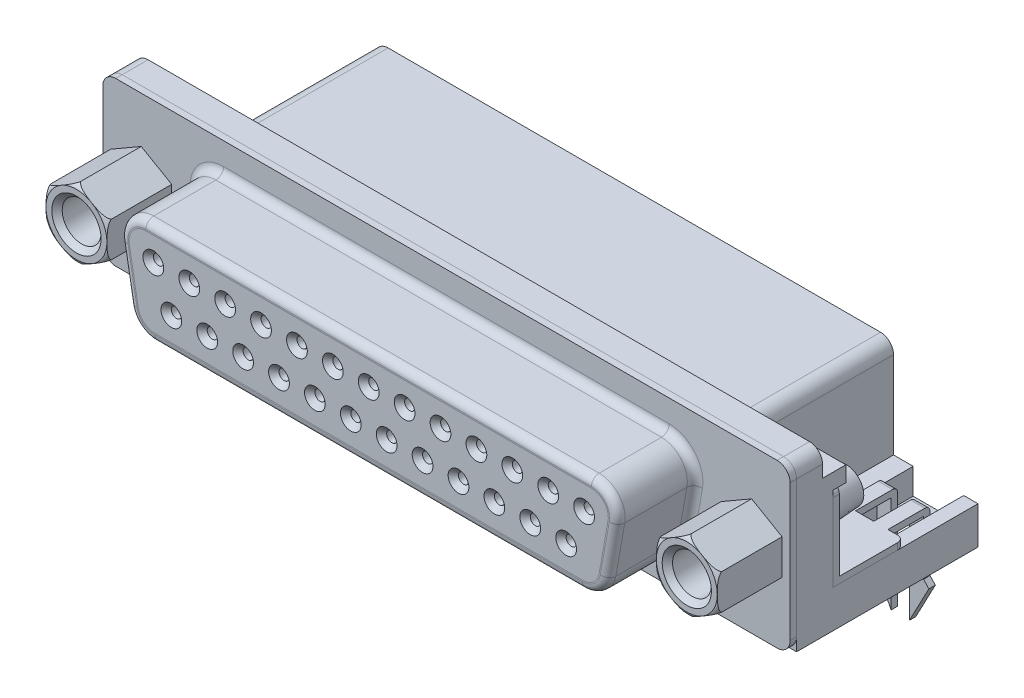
from build123d import *

# Parameters (mm, degrees)
EXTRUIR1_DEPTH         = 0.5
EXTRUIR2_DEPTH         = 6
CORTAR_EXTRUIR1_DEPTH  = 6
REDONDEO1_R            = 0.6
CROQUIS5_R             = 0.4
EXTRUIR3_DEPTH         = 6
CHAFL_N1_SIZE          = 0.4
CROQUIS6_R             = 1.6
CORTAR_EXTRUIR2_DEPTH  = 6
EXTRUIR4_DEPTH         = 5
CROQUIS9_R             = 1.5
CORTAR_EXTRUIR3_DEPTH  = 4
CHAFL_N2_SIZE          = 0.4
EXTRUIR5_DEPTH         = 14
CORTAR_EXTRUIR4_DEPTH  = 12
REDONDEO2_R            = 1
EXTRUIR6_DEPTH         = 53.04
CROQUIS13_W            = 3.9
CROQUIS13_H            = 13.996987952
CORTAR_EXTRUIR5_DEPTH  = 2
CROQUIS14_W            = 39.5
CROQUIS14_H            = 13.668273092
CORTAR_EXTRUIR6_DEPTH  = 0.6
EXTRUIR7_DEPTH         = 4.4
EXTRUIR7_DEPTH_BACK    = 2
CROQUIS15_W            = 0.7
CROQUIS15_H            = 0.7
EXTRUIR7_2_DEPTH       = 4.4
EXTRUIR7_2_DEPTH_BACK  = 2
EXTRUIR7_3_DEPTH       = 4.4
EXTRUIR7_3_DEPTH_BACK  = 2
EXTRUIR7_4_DEPTH       = 4.4
EXTRUIR7_4_DEPTH_BACK  = 2
EXTRUIR7_5_DEPTH       = 4.4
EXTRUIR7_5_DEPTH_BACK  = 2
EXTRUIR7_6_DEPTH       = 4.4
EXTRUIR7_6_DEPTH_BACK  = 2
EXTRUIR7_7_DEPTH       = 4.4
EXTRUIR7_7_DEPTH_BACK  = 2
EXTRUIR7_8_DEPTH       = 4.4
EXTRUIR7_8_DEPTH_BACK  = 2
EXTRUIR7_9_DEPTH       = 4.4
EXTRUIR7_9_DEPTH_BACK  = 2
EXTRUIR7_10_DEPTH      = 4.4
EXTRUIR7_10_DEPTH_BACK = 2
EXTRUIR7_11_DEPTH      = 4.4
EXTRUIR7_11_DEPTH_BACK = 2
EXTRUIR7_12_DEPTH      = 4.4
EXTRUIR7_12_DEPTH_BACK = 2
EXTRUIR7_13_DEPTH      = 4.4
EXTRUIR7_13_DEPTH_BACK = 2
EXTRUIR7_14_DEPTH      = 4.4
EXTRUIR7_14_DEPTH_BACK = 2
EXTRUIR7_15_DEPTH      = 4.4
EXTRUIR7_15_DEPTH_BACK = 2
EXTRUIR7_16_DEPTH      = 4.4
EXTRUIR7_16_DEPTH_BACK = 2
EXTRUIR7_17_DEPTH      = 4.4
EXTRUIR7_17_DEPTH_BACK = 2
EXTRUIR7_18_DEPTH      = 4.4
EXTRUIR7_18_DEPTH_BACK = 2
EXTRUIR7_19_DEPTH      = 4.4
EXTRUIR7_19_DEPTH_BACK = 2
EXTRUIR7_20_DEPTH      = 4.4
EXTRUIR7_20_DEPTH_BACK = 2
EXTRUIR7_21_DEPTH      = 4.4
EXTRUIR7_21_DEPTH_BACK = 2
EXTRUIR7_22_DEPTH      = 4.4
EXTRUIR7_22_DEPTH_BACK = 2
EXTRUIR7_23_DEPTH      = 4.4
EXTRUIR7_23_DEPTH_BACK = 2
EXTRUIR7_24_DEPTH      = 4.4
EXTRUIR7_24_DEPTH_BACK = 2
EXTRUIR7_25_DEPTH      = 4.4
EXTRUIR7_25_DEPTH_BACK = 2
CROQUIS16_W            = 0.7
CROQUIS16_H            = 4.035508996
CROQUIS16_H_2          = 6.875508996
CORTAR_EXTRUIR7_DEPTH  = 2
CORTAR_EXTRUIR9_DEPTH  = 4
EXTRUIR8_DEPTH         = 0.5
CROQUIS19_W            = 1.1
CROQUIS19_H            = 3.25
EXTRUIR9_DEPTH         = 0.5
REDONDEO3_R            = 0.4
EXTRUIR10_DEPTH        = 0.5
EXTRUIR10_2_DEPTH      = 0.5
REDONDEO4_R            = 0.4
CROQUIS21_R            = 1.6
EXTRUIR11_DEPTH        = 3.5
EXTRUIR11_TAPER        = 4
CROQUIS22_W            = 37
CROQUIS22_H            = 6
CROQUIS22_W_2          = 36.8
CROQUIS22_H_2          = 5.8
CORTAR_EXTRUIR10_DEPTH = 6.5


with BuildPart() as part:
    # Croquis1 → Extruir1 (new body)
    with BuildSketch(Plane.XY):
        with BuildLine():
            Line((-25.52, 6.275), (25.52, 6.275))
            ThreePointArc((25.52, 6.275), (26.227106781, 5.982106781), (26.52, 5.275))
            Line((26.52, 5.275), (26.52, -5.275))
            ThreePointArc((26.52, -5.275), (26.227106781, -5.982106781), (25.52, -6.275))
            Line((25.52, -6.275), (-25.52, -6.275))
            ThreePointArc((-25.52, -6.275), (-26.227106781, -5.982106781), (-26.52, -5.275))
            Line((-26.52, -5.275), (-26.52, 5.275))
            ThreePointArc((-26.52, 5.275), (-26.227106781, 5.982106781), (-25.52, 6.275))
        make_face()
    extrude(amount=EXTRUIR1_DEPTH)

    # Croquis2 → Extruir2 (add)
    with BuildSketch(Plane.XY.offset(0.5)):
        with BuildLine():
            Line((19.159615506, 1.602703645), (18.471940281, -2.297296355))
            ThreePointArc((18.471940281, -2.297296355), (17.787899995, -3.482088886), (16.502324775, -3.95))
            Line((16.502324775, -3.95), (-16.502324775, -3.95))
            ThreePointArc((-16.502324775, -3.95), (-17.787899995, -3.482088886), (-18.471940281, -2.297296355))
            Line((-18.471940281, -2.297296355), (-19.159615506, 1.602703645))
            ThreePointArc((-19.159615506, 1.602703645), (-18.722088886, 3.235575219), (-17.19, 3.95))
            Line((-17.19, 3.95), (17.19, 3.95))
            ThreePointArc((17.19, 3.95), (18.722088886, 3.235575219), (19.159615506, 1.602703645))
        make_face()
    extrude(amount=EXTRUIR2_DEPTH)

    # Croquis3 → Cortar-Extruir1 (cut)
    with BuildSketch(Plane.XY.offset(6.5)):
        with BuildLine():
            Line((17.19, 3.25), (-17.19, 3.25))
            ThreePointArc((-17.19, 3.25), (-18.185857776, 2.785623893), (-18.470250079, 1.724257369))
            Line((-18.470250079, 1.724257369), (-17.782574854, -2.175742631))
            ThreePointArc((-17.782574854, -2.175742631), (-17.337948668, -2.945857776), (-16.502324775, -3.25))
            Line((-16.502324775, -3.25), (16.502324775, -3.25))
            ThreePointArc((16.502324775, -3.25), (17.337948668, -2.945857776), (17.782574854, -2.175742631))
            Line((17.782574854, -2.175742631), (18.470250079, 1.724257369))
            ThreePointArc((18.470250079, 1.724257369), (18.185857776, 2.785623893), (17.19, 3.25))
        make_face()
    extrude(amount=-CORTAR_EXTRUIR1_DEPTH, mode=Mode.SUBTRACT)

    # Redondeo1
    redondeo1_edges = [part.edges().sort_by_distance(p)[0] for p in [
        (17.787899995, -3.482088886, 0.5),
        (18.815777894, -0.347296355, 0.5),
        (18.722088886, 3.235575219, 0.5),
        (0, 3.95, 0.5),
        (-18.722088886, 3.235575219, 0.5),
        (-18.815777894, -0.347296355, 0.5),
        (-17.787899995, -3.482088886, 0.5),
        (0, -3.95, 0.5),
        (17.787899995, -3.482088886, 6.5),
        (18.815777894, -0.347296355, 6.5),
        (18.722088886, 3.235575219, 6.5),
        (0, 3.95, 6.5),
        (-18.722088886, 3.235575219, 6.5),
        (-18.815777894, -0.347296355, 6.5),
        (-17.787899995, -3.482088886, 6.5),
        (0, -3.95, 6.5),
    ]]
    fillet(redondeo1_edges, radius=REDONDEO1_R)

    # Croquis6 → Cortar-Extruir2 (cut)
    with BuildSketch(Plane.XY.offset(0.5)):
        with Locations((23.55, 0)):
            Circle(CROQUIS6_R)
        with Locations((-23.55, 0)):
            Circle(CROQUIS6_R)
    extrude(amount=-CORTAR_EXTRUIR2_DEPTH, mode=Mode.SUBTRACT)


with BuildPart() as body_2:
    # Croquis5 → Extruir3 (new body)
    with BuildSketch(Plane.XY.offset(0.5)):
        with BuildLine():
            Line((17.19, 3.25), (-17.19, 3.25))
            ThreePointArc((-17.19, 3.25), (-18.185857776, 2.785623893), (-18.470250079, 1.724257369))
            Line((-18.470250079, 1.724257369), (-17.782574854, -2.175742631))
            ThreePointArc((-17.782574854, -2.175742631), (-17.337948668, -2.945857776), (-16.502324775, -3.25))
            Line((-16.502324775, -3.25), (16.502324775, -3.25))
            ThreePointArc((16.502324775, -3.25), (17.337948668, -2.945857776), (17.782574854, -2.175742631))
            Line((17.782574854, -2.175742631), (18.470250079, 1.724257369))
            ThreePointArc((18.470250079, 1.724257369), (18.185857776, 2.785623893), (17.19, 3.25))
        make_face()
        with Locations((16.625, 1.42)):
            Circle(CROQUIS5_R, mode=Mode.SUBTRACT)
        with Locations((13.855, 1.42)):
            Circle(CROQUIS5_R, mode=Mode.SUBTRACT)
        with Locations((11.085, 1.42)):
            Circle(CROQUIS5_R, mode=Mode.SUBTRACT)
        with Locations((8.315, 1.42)):
            Circle(CROQUIS5_R, mode=Mode.SUBTRACT)
        with Locations((5.545, 1.42)):
            Circle(CROQUIS5_R, mode=Mode.SUBTRACT)
        with Locations((2.775, 1.42)):
            Circle(CROQUIS5_R, mode=Mode.SUBTRACT)
        with Locations((0.005, 1.42)):
            Circle(CROQUIS5_R, mode=Mode.SUBTRACT)
        with Locations((-2.765, 1.42)):
            Circle(CROQUIS5_R, mode=Mode.SUBTRACT)
        with Locations((-5.535, 1.42)):
            Circle(CROQUIS5_R, mode=Mode.SUBTRACT)
        with Locations((-8.305, 1.42)):
            Circle(CROQUIS5_R, mode=Mode.SUBTRACT)
        with Locations((-11.075, 1.42)):
            Circle(CROQUIS5_R, mode=Mode.SUBTRACT)
        with Locations((-13.845, 1.42)):
            Circle(CROQUIS5_R, mode=Mode.SUBTRACT)
        with Locations((-16.615, 1.42)):
            Circle(CROQUIS5_R, mode=Mode.SUBTRACT)
        with Locations((15.24, -1.42)):
            Circle(CROQUIS5_R, mode=Mode.SUBTRACT)
        with Locations((12.47, -1.42)):
            Circle(CROQUIS5_R, mode=Mode.SUBTRACT)
        with Locations((9.7, -1.42)):
            Circle(CROQUIS5_R, mode=Mode.SUBTRACT)
        with Locations((6.93, -1.42)):
            Circle(CROQUIS5_R, mode=Mode.SUBTRACT)
        with Locations((4.16, -1.42)):
            Circle(CROQUIS5_R, mode=Mode.SUBTRACT)
        with Locations((1.39, -1.42)):
            Circle(CROQUIS5_R, mode=Mode.SUBTRACT)
        with Locations((-1.38, -1.42)):
            Circle(CROQUIS5_R, mode=Mode.SUBTRACT)
        with Locations((-4.15, -1.42)):
            Circle(CROQUIS5_R, mode=Mode.SUBTRACT)
        with Locations((-6.92, -1.42)):
            Circle(CROQUIS5_R, mode=Mode.SUBTRACT)
        with Locations((-9.69, -1.42)):
            Circle(CROQUIS5_R, mode=Mode.SUBTRACT)
        with Locations((-12.46, -1.42)):
            Circle(CROQUIS5_R, mode=Mode.SUBTRACT)
        with Locations((-15.23, -1.42)):
            Circle(CROQUIS5_R, mode=Mode.SUBTRACT)
    extrude(amount=EXTRUIR3_DEPTH)

    # Chafl_n1
    chafl_n1_edges = [body_2.edges().sort_by_distance(p)[0] for p in [
        (-7.32, -1.42, 6.5),
        (-10.09, -1.42, 6.5),
        (-12.86, -1.42, 6.5),
        (-15.63, -1.42, 6.5),
        (16.225, 1.42, 6.5),
        (13.455, 1.42, 6.5),
        (10.685, 1.42, 6.5),
        (7.915, 1.42, 6.5),
        (5.145, 1.42, 6.5),
        (2.375, 1.42, 6.5),
        (-0.395, 1.42, 6.5),
        (-3.165, 1.42, 6.5),
        (-5.935, 1.42, 6.5),
        (-8.705, 1.42, 6.5),
        (-11.475, 1.42, 6.5),
        (-14.245, 1.42, 6.5),
        (-17.015, 1.42, 6.5),
        (14.84, -1.42, 6.5),
        (12.07, -1.42, 6.5),
        (9.3, -1.42, 6.5),
        (6.53, -1.42, 6.5),
        (3.76, -1.42, 6.5),
        (0.99, -1.42, 6.5),
        (-1.78, -1.42, 6.5),
        (-4.55, -1.42, 6.5),
    ]]
    chamfer(chafl_n1_edges, length=CHAFL_N1_SIZE)


with BuildPart() as body_3:
    # Croquis7 → Extruir4 (new body)
    with BuildSketch(Plane.XY.offset(0.5)):
        Polygon((23.55, 2.713546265), (21.2, 1.356773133), (21.2, -1.356773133), (23.55, -2.713546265), (25.9, -1.356773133), (25.9, 1.356773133), align=None)
    extrude(amount=EXTRUIR4_DEPTH)

    # Croquis8 → Cortar-Revoluci_n1 (revolve, cut)
    with BuildSketch(Plane(origin=(23.55, 0, 0), x_dir=(0, 0, -1), z_dir=(1, 0, 0))):
        with BuildLine():
            Line((-5.162976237, 2.713546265), (-5.162976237, 5.085332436))
            Line((-5.162976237, 5.085332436), (-6.486384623, 5.085332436))
            Line((-6.486384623, 5.085332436), (-6.187801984, 2.35))
            Line((-6.187801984, 2.35), (-5.5, 2.35))
            ThreePointArc((-5.5, 2.35), (-5.375308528, 2.572396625), (-5.162976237, 2.713546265))
        make_face()
    revolve(axis=Axis((23.55, 0, 0), (0, 0, -1)), mode=Mode.SUBTRACT)

    # Croquis9 → Cortar-Extruir3 (cut)
    with BuildSketch(Plane.XY.offset(5.5)):
        with Locations((23.55, 0)):
            Circle(CROQUIS9_R)
    extrude(amount=-CORTAR_EXTRUIR3_DEPTH, mode=Mode.SUBTRACT)

    # Chafl_n2
    chafl_n2_edges = [body_3.edges().sort_by_distance(p)[0] for p in [
        (22.05, 0, 5.5),
    ]]
    chamfer(chafl_n2_edges, length=CHAFL_N2_SIZE)


with BuildPart() as body_4:
    # Simetr_a1: mirrored copy
    add(body_3.part.mirror(Plane(origin=(0, 0, 0), x_dir=(0, 0, 1), z_dir=(1, 0, 0))))


with BuildPart() as body_5:
    # Croquis10 → Extruir5 (new body)
    with BuildSketch(Plane(origin=(0, 0, 0), x_dir=(-1, 0, 0), z_dir=(0, 0, -1))):
        with BuildLine():
            Line((-25.52, 6.275), (25.52, 6.275))
            ThreePointArc((25.52, 6.275), (26.227106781, 5.982106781), (26.52, 5.275))
            Line((26.52, 5.275), (26.52, -6.275))
            Line((26.52, -6.275), (-26.52, -6.275))
            Line((-26.52, -6.275), (-26.52, 5.275))
            ThreePointArc((-26.52, 5.275), (-26.227106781, 5.982106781), (-25.52, 6.275))
        make_face()
    extrude(amount=EXTRUIR5_DEPTH)

    # Croquis11 → Cortar-Extruir4 (cut)
    with BuildSketch(Plane(origin=(0, 0, -14), x_dir=(-1, 0, 0), z_dir=(0, 0, -1))):
        Polygon((30.029317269, -3.375), (20, -3.375), (20, 4.325), (-20, 4.325), (-20, -3.375), (-30.65060241, -3.375), (-30.65060241, 10.825803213), (30.029317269, 10.825803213), align=None)
    extrude(amount=-CORTAR_EXTRUIR4_DEPTH, mode=Mode.SUBTRACT)

    # Redondeo2
    redondeo2_edges = [body_5.edges().sort_by_distance(p)[0] for p in [
        (-20, 4.325, -8),
        (20, 4.325, -8),
    ]]
    fillet(redondeo2_edges, radius=REDONDEO2_R)


with BuildPart() as body_6:
    # Croquis12 → Extruir6 (new body)
    with BuildSketch(Plane(origin=(26.52, 0, 0), x_dir=(0, 0, -1), z_dir=(1, 0, 0))):
        Polygon((2, 4.325), (3.8, 4.325), (3.8, 3.125), (2.8, 3.125), (2.8, -3.375), (2, -3.375), align=None)
    extrude(amount=-EXTRUIR6_DEPTH)


with BuildPart() as body_5_1:
    add(body_5.part)

    # Combinar1: union body 6
    add(body_6.part)

    # Croquis13 → Cortar-Extruir5 (cut)
    with BuildSketch(Plane(origin=(0, -3.375, 0), x_dir=(-1, 0, 0), z_dir=(0, 1, 0))):
        with Locations((-23.47, -9.798493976)):
            Rectangle(CROQUIS13_W, CROQUIS13_H)
        with Locations((23.47, -9.798493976)):
            Rectangle(CROQUIS13_W, CROQUIS13_H)
    extrude(amount=-CORTAR_EXTRUIR5_DEPTH, mode=Mode.SUBTRACT)

    # Croquis14 → Cortar-Extruir6 (cut)
    with BuildSketch(Plane.XZ.offset(6.275)):
        with Locations((0, -8.834136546)):
            Rectangle(CROQUIS14_W, CROQUIS14_H)
    extrude(amount=-CORTAR_EXTRUIR6_DEPTH, mode=Mode.SUBTRACT)

    # Croquis16 → Cortar-Extruir7 (cut)
    with BuildSketch(Plane.XZ.offset(5.675)):
        with Locations((16.625, -14.017754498)):
            Rectangle(CROQUIS16_W, CROQUIS16_H)
        with Locations((13.855, -14.017754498)):
            Rectangle(CROQUIS16_W, CROQUIS16_H)
        with Locations((15.24, -12.597754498)):
            Rectangle(CROQUIS16_W, CROQUIS16_H_2)
        with Locations((12.47, -12.597754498)):
            Rectangle(CROQUIS16_W, CROQUIS16_H_2)
        with Locations((11.085, -14.017754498)):
            Rectangle(CROQUIS16_W, CROQUIS16_H)
        with Locations((9.7, -12.597754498)):
            Rectangle(CROQUIS16_W, CROQUIS16_H_2)
        with Locations((8.315, -14.017754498)):
            Rectangle(CROQUIS16_W, CROQUIS16_H)
        with Locations((6.93, -12.597754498)):
            Rectangle(CROQUIS16_W, CROQUIS16_H_2)
        with Locations((5.545, -14.017754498)):
            Rectangle(CROQUIS16_W, CROQUIS16_H)
        with Locations((4.16, -12.597754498)):
            Rectangle(CROQUIS16_W, CROQUIS16_H_2)
        with Locations((2.775, -14.017754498)):
            Rectangle(CROQUIS16_W, CROQUIS16_H)
        with Locations((1.39, -12.597754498)):
            Rectangle(CROQUIS16_W, CROQUIS16_H_2)
        with Locations((0.005, -14.017754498)):
            Rectangle(CROQUIS16_W, CROQUIS16_H)
        with Locations((-1.38, -12.597754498)):
            Rectangle(CROQUIS16_W, CROQUIS16_H_2)
        with Locations((-2.765, -14.017754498)):
            Rectangle(CROQUIS16_W, CROQUIS16_H)
        with Locations((-4.15, -12.597754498)):
            Rectangle(CROQUIS16_W, CROQUIS16_H_2)
        with Locations((-5.535, -14.017754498)):
            Rectangle(CROQUIS16_W, CROQUIS16_H)
        with Locations((-6.92, -12.597754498)):
            Rectangle(CROQUIS16_W, CROQUIS16_H_2)
        with Locations((-8.305, -14.017754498)):
            Rectangle(CROQUIS16_W, CROQUIS16_H)
        with Locations((-9.69, -12.597754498)):
            Rectangle(CROQUIS16_W, CROQUIS16_H_2)
        with Locations((-11.075, -14.017754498)):
            Rectangle(CROQUIS16_W, CROQUIS16_H)
        with Locations((-12.46, -12.597754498)):
            Rectangle(CROQUIS16_W, CROQUIS16_H_2)
        with Locations((-13.845, -14.017754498)):
            Rectangle(CROQUIS16_W, CROQUIS16_H)
        with Locations((-15.23, -12.597754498)):
            Rectangle(CROQUIS16_W, CROQUIS16_H_2)
        with Locations((-16.615, -14.017754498)):
            Rectangle(CROQUIS16_W, CROQUIS16_H)
    extrude(amount=-CORTAR_EXTRUIR7_DEPTH, mode=Mode.SUBTRACT)

    # Croquis17 → Cortar-Extruir9 (cut)
    with BuildSketch(Plane(origin=(0, -5.375, 0), x_dir=(-1, 0, 0), z_dir=(0, 1, 0))):
        with BuildLine():
            Line((-21.52, -9.3), (-21.52, -11.3))
            ThreePointArc((-21.52, -11.3), (-23.47, -13.25), (-25.42, -11.3))
            Line((-25.42, -11.3), (-25.42, -9.3))
            ThreePointArc((-25.42, -9.3), (-23.47, -7.35), (-21.52, -9.3))
        make_face()
        with BuildLine():
            Line((25.42, -9.3), (25.42, -11.3))
            ThreePointArc((25.42, -11.3), (23.47, -13.25), (21.52, -11.3))
            Line((21.52, -11.3), (21.52, -9.3))
            ThreePointArc((21.52, -9.3), (23.47, -7.35), (25.42, -9.3))
        make_face()
    extrude(amount=-CORTAR_EXTRUIR9_DEPTH, mode=Mode.SUBTRACT)

    # Redondeo3
    redondeo3_edges = [body_5_1.edges().sort_by_distance(p)[0] for p in [
        (25.97, -3.375, -2.8),
    ]]
    fillet(redondeo3_edges, radius=REDONDEO3_R)

    # Croquis22 → Cortar-Extruir10 (cut)
    with BuildSketch(Plane(origin=(0, 0, -14), x_dir=(-1, 0, 0), z_dir=(0, 0, -1))):
        with Locations((0, -0.675)):
            Rectangle(CROQUIS22_W, CROQUIS22_H)
        with Locations((0, -0.675)):
            Rectangle(CROQUIS22_W_2, CROQUIS22_H_2, mode=Mode.SUBTRACT)
    extrude(amount=-CORTAR_EXTRUIR10_DEPTH, mode=Mode.SUBTRACT)


with BuildPart() as body_6_2:
    # Croquis15 → Extruir7 (new, two sides: drawn at the far end of the back side and taken through both)
    with BuildSketch(Plane.XZ.offset(5.675).offset(-EXTRUIR7_DEPTH_BACK)):
        with Locations((16.625, -12.35)):
            Rectangle(CROQUIS15_W, CROQUIS15_H)
    extrude(amount=EXTRUIR7_DEPTH + EXTRUIR7_DEPTH_BACK)


with BuildPart() as body_7:
    # Croquis15 → Extruir7 2 (new, two sides: drawn at the far end of the back side and taken through both)
    with BuildSketch(Plane.XZ.offset(5.675).offset(-EXTRUIR7_2_DEPTH_BACK)):
        with Locations((13.855, -12.35)):
            Rectangle(CROQUIS15_W, CROQUIS15_H)
    extrude(amount=EXTRUIR7_2_DEPTH + EXTRUIR7_2_DEPTH_BACK)


with BuildPart() as body_8:
    # Croquis15 → Extruir7 3 (new, two sides: drawn at the far end of the back side and taken through both)
    with BuildSketch(Plane.XZ.offset(5.675).offset(-EXTRUIR7_3_DEPTH_BACK)):
        with Locations((11.085, -12.35)):
            Rectangle(CROQUIS15_W, CROQUIS15_H)
    extrude(amount=EXTRUIR7_3_DEPTH + EXTRUIR7_3_DEPTH_BACK)


with BuildPart() as body_9:
    # Croquis15 → Extruir7 4 (new, two sides: drawn at the far end of the back side and taken through both)
    with BuildSketch(Plane.XZ.offset(5.675).offset(-EXTRUIR7_4_DEPTH_BACK)):
        with Locations((8.315, -12.35)):
            Rectangle(CROQUIS15_W, CROQUIS15_H)
    extrude(amount=EXTRUIR7_4_DEPTH + EXTRUIR7_4_DEPTH_BACK)


with BuildPart() as body_10:
    # Croquis15 → Extruir7 5 (new, two sides: drawn at the far end of the back side and taken through both)
    with BuildSketch(Plane.XZ.offset(5.675).offset(-EXTRUIR7_5_DEPTH_BACK)):
        with Locations((5.545, -12.35)):
            Rectangle(CROQUIS15_W, CROQUIS15_H)
    extrude(amount=EXTRUIR7_5_DEPTH + EXTRUIR7_5_DEPTH_BACK)


with BuildPart() as body_11:
    # Croquis15 → Extruir7 6 (new, two sides: drawn at the far end of the back side and taken through both)
    with BuildSketch(Plane.XZ.offset(5.675).offset(-EXTRUIR7_6_DEPTH_BACK)):
        with Locations((2.775, -12.35)):
            Rectangle(CROQUIS15_W, CROQUIS15_H)
    extrude(amount=EXTRUIR7_6_DEPTH + EXTRUIR7_6_DEPTH_BACK)


with BuildPart() as body_12:
    # Croquis15 → Extruir7 7 (new, two sides: drawn at the far end of the back side and taken through both)
    with BuildSketch(Plane.XZ.offset(5.675).offset(-EXTRUIR7_7_DEPTH_BACK)):
        with Locations((0.005, -12.35)):
            Rectangle(CROQUIS15_W, CROQUIS15_H)
    extrude(amount=EXTRUIR7_7_DEPTH + EXTRUIR7_7_DEPTH_BACK)


with BuildPart() as body_13:
    # Croquis15 → Extruir7 8 (new, two sides: drawn at the far end of the back side and taken through both)
    with BuildSketch(Plane.XZ.offset(5.675).offset(-EXTRUIR7_8_DEPTH_BACK)):
        with Locations((-2.765, -12.35)):
            Rectangle(CROQUIS15_W, CROQUIS15_H)
    extrude(amount=EXTRUIR7_8_DEPTH + EXTRUIR7_8_DEPTH_BACK)


with BuildPart() as body_14:
    # Croquis15 → Extruir7 9 (new, two sides: drawn at the far end of the back side and taken through both)
    with BuildSketch(Plane.XZ.offset(5.675).offset(-EXTRUIR7_9_DEPTH_BACK)):
        with Locations((-5.535, -12.35)):
            Rectangle(CROQUIS15_W, CROQUIS15_H)
    extrude(amount=EXTRUIR7_9_DEPTH + EXTRUIR7_9_DEPTH_BACK)


with BuildPart() as body_15:
    # Croquis15 → Extruir7 10 (new, two sides: drawn at the far end of the back side and taken through both)
    with BuildSketch(Plane.XZ.offset(5.675).offset(-EXTRUIR7_10_DEPTH_BACK)):
        with Locations((-8.305, -12.35)):
            Rectangle(CROQUIS15_W, CROQUIS15_H)
    extrude(amount=EXTRUIR7_10_DEPTH + EXTRUIR7_10_DEPTH_BACK)


with BuildPart() as body_16:
    # Croquis15 → Extruir7 11 (new, two sides: drawn at the far end of the back side and taken through both)
    with BuildSketch(Plane.XZ.offset(5.675).offset(-EXTRUIR7_11_DEPTH_BACK)):
        with Locations((-11.075, -12.35)):
            Rectangle(CROQUIS15_W, CROQUIS15_H)
    extrude(amount=EXTRUIR7_11_DEPTH + EXTRUIR7_11_DEPTH_BACK)


with BuildPart() as body_17:
    # Croquis15 → Extruir7 12 (new, two sides: drawn at the far end of the back side and taken through both)
    with BuildSketch(Plane.XZ.offset(5.675).offset(-EXTRUIR7_12_DEPTH_BACK)):
        with Locations((-13.845, -12.35)):
            Rectangle(CROQUIS15_W, CROQUIS15_H)
    extrude(amount=EXTRUIR7_12_DEPTH + EXTRUIR7_12_DEPTH_BACK)


with BuildPart() as body_18:
    # Croquis15 → Extruir7 13 (new, two sides: drawn at the far end of the back side and taken through both)
    with BuildSketch(Plane.XZ.offset(5.675).offset(-EXTRUIR7_13_DEPTH_BACK)):
        with Locations((-16.615, -12.35)):
            Rectangle(CROQUIS15_W, CROQUIS15_H)
    extrude(amount=EXTRUIR7_13_DEPTH + EXTRUIR7_13_DEPTH_BACK)


with BuildPart() as body_19:
    # Croquis15 → Extruir7 14 (new, two sides: drawn at the far end of the back side and taken through both)
    with BuildSketch(Plane.XZ.offset(5.675).offset(-EXTRUIR7_14_DEPTH_BACK)):
        with Locations((15.24, -9.51)):
            Rectangle(CROQUIS15_W, CROQUIS15_H)
    extrude(amount=EXTRUIR7_14_DEPTH + EXTRUIR7_14_DEPTH_BACK)


with BuildPart() as body_20:
    # Croquis15 → Extruir7 15 (new, two sides: drawn at the far end of the back side and taken through both)
    with BuildSketch(Plane.XZ.offset(5.675).offset(-EXTRUIR7_15_DEPTH_BACK)):
        with Locations((12.47, -9.51)):
            Rectangle(CROQUIS15_W, CROQUIS15_H)
    extrude(amount=EXTRUIR7_15_DEPTH + EXTRUIR7_15_DEPTH_BACK)


with BuildPart() as body_21:
    # Croquis15 → Extruir7 16 (new, two sides: drawn at the far end of the back side and taken through both)
    with BuildSketch(Plane.XZ.offset(5.675).offset(-EXTRUIR7_16_DEPTH_BACK)):
        with Locations((9.7, -9.51)):
            Rectangle(CROQUIS15_W, CROQUIS15_H)
    extrude(amount=EXTRUIR7_16_DEPTH + EXTRUIR7_16_DEPTH_BACK)


with BuildPart() as body_22:
    # Croquis15 → Extruir7 17 (new, two sides: drawn at the far end of the back side and taken through both)
    with BuildSketch(Plane.XZ.offset(5.675).offset(-EXTRUIR7_17_DEPTH_BACK)):
        with Locations((6.93, -9.51)):
            Rectangle(CROQUIS15_W, CROQUIS15_H)
    extrude(amount=EXTRUIR7_17_DEPTH + EXTRUIR7_17_DEPTH_BACK)


with BuildPart() as body_23:
    # Croquis15 → Extruir7 18 (new, two sides: drawn at the far end of the back side and taken through both)
    with BuildSketch(Plane.XZ.offset(5.675).offset(-EXTRUIR7_18_DEPTH_BACK)):
        with Locations((4.16, -9.51)):
            Rectangle(CROQUIS15_W, CROQUIS15_H)
    extrude(amount=EXTRUIR7_18_DEPTH + EXTRUIR7_18_DEPTH_BACK)


with BuildPart() as body_24:
    # Croquis15 → Extruir7 19 (new, two sides: drawn at the far end of the back side and taken through both)
    with BuildSketch(Plane.XZ.offset(5.675).offset(-EXTRUIR7_19_DEPTH_BACK)):
        with Locations((1.39, -9.51)):
            Rectangle(CROQUIS15_W, CROQUIS15_H)
    extrude(amount=EXTRUIR7_19_DEPTH + EXTRUIR7_19_DEPTH_BACK)


with BuildPart() as body_25:
    # Croquis15 → Extruir7 20 (new, two sides: drawn at the far end of the back side and taken through both)
    with BuildSketch(Plane.XZ.offset(5.675).offset(-EXTRUIR7_20_DEPTH_BACK)):
        with Locations((-1.38, -9.51)):
            Rectangle(CROQUIS15_W, CROQUIS15_H)
    extrude(amount=EXTRUIR7_20_DEPTH + EXTRUIR7_20_DEPTH_BACK)


with BuildPart() as body_26:
    # Croquis15 → Extruir7 21 (new, two sides: drawn at the far end of the back side and taken through both)
    with BuildSketch(Plane.XZ.offset(5.675).offset(-EXTRUIR7_21_DEPTH_BACK)):
        with Locations((-4.15, -9.51)):
            Rectangle(CROQUIS15_W, CROQUIS15_H)
    extrude(amount=EXTRUIR7_21_DEPTH + EXTRUIR7_21_DEPTH_BACK)


with BuildPart() as body_27:
    # Croquis15 → Extruir7 22 (new, two sides: drawn at the far end of the back side and taken through both)
    with BuildSketch(Plane.XZ.offset(5.675).offset(-EXTRUIR7_22_DEPTH_BACK)):
        with Locations((-6.92, -9.51)):
            Rectangle(CROQUIS15_W, CROQUIS15_H)
    extrude(amount=EXTRUIR7_22_DEPTH + EXTRUIR7_22_DEPTH_BACK)


with BuildPart() as body_28:
    # Croquis15 → Extruir7 23 (new, two sides: drawn at the far end of the back side and taken through both)
    with BuildSketch(Plane.XZ.offset(5.675).offset(-EXTRUIR7_23_DEPTH_BACK)):
        with Locations((-9.69, -9.51)):
            Rectangle(CROQUIS15_W, CROQUIS15_H)
    extrude(amount=EXTRUIR7_23_DEPTH + EXTRUIR7_23_DEPTH_BACK)


with BuildPart() as body_29:
    # Croquis15 → Extruir7 24 (new, two sides: drawn at the far end of the back side and taken through both)
    with BuildSketch(Plane.XZ.offset(5.675).offset(-EXTRUIR7_24_DEPTH_BACK)):
        with Locations((-12.46, -9.51)):
            Rectangle(CROQUIS15_W, CROQUIS15_H)
    extrude(amount=EXTRUIR7_24_DEPTH + EXTRUIR7_24_DEPTH_BACK)


with BuildPart() as body_30:
    # Croquis15 → Extruir7 25 (new, two sides: drawn at the far end of the back side and taken through both)
    with BuildSketch(Plane.XZ.offset(5.675).offset(-EXTRUIR7_25_DEPTH_BACK)):
        with Locations((-15.23, -9.51)):
            Rectangle(CROQUIS15_W, CROQUIS15_H)
    extrude(amount=EXTRUIR7_25_DEPTH + EXTRUIR7_25_DEPTH_BACK)


with BuildPart() as body_31:
    # Croquis18 → Extruir8 (new body)
    with BuildSketch(Plane(origin=(0, 0, -2.8), x_dir=(-1, 0, 0), z_dir=(0, 0, -1))):
        with BuildLine():
            Line((-26.02, 3.125), (-21.022352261, 3.125))
            ThreePointArc((-21.022352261, 3.125), (-20.66879887, 2.978553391), (-20.522352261, 2.625))
            Line((-20.522352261, 2.625), (-20.522352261, -3.375))
            Line((-20.522352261, -3.375), (-26.52, -3.375))
            Line((-26.52, -3.375), (-26.52, 2.625))
            ThreePointArc((-26.52, 2.625), (-26.373553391, 2.978553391), (-26.02, 3.125))
        make_face()
    extrude(amount=EXTRUIR8_DEPTH)


with BuildPart() as body_32:
    # Croquis19 → Extruir9 (new body)
    with BuildSketch(Plane(origin=(0, -3.375, 0), x_dir=(-1, 0, 0), z_dir=(0, 1, 0))):
        with BuildLine():
            Line((-20.522352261, -7.8), (-20.522352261, -3.3))
            Line((-20.522352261, -3.3), (-25.42, -3.3))
            Line((-25.42, -3.3), (-25.42, -8.3))
            Line((-25.42, -8.3), (-25.27, -8.3))
            Line((-25.27, -8.3), (-25.27, -11.55))
            Line((-25.27, -11.55), (-24.17, -11.55))
            Line((-24.17, -11.55), (-24.17, -8.3))
            Line((-24.17, -8.3), (-22.77, -8.3))
            Line((-22.77, -8.3), (-21.67, -8.3))
            Line((-21.67, -8.3), (-21.022352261, -8.3))
            ThreePointArc((-21.022352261, -8.3), (-20.66879887, -8.153553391), (-20.522352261, -7.8))
        make_face()
        with BuildLine():
            Line((-25.42, -8.3), (-25.42, -3.3))
            Line((-25.42, -3.3), (-26.52, -3.3))
            Line((-26.52, -3.3), (-26.52, -7.8))
            ThreePointArc((-26.52, -7.8), (-26.373553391, -8.153553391), (-26.02, -8.3))
            Line((-26.02, -8.3), (-25.42, -8.3))
        make_face()
        with Locations((-22.22, -9.925)):
            Rectangle(CROQUIS19_W, CROQUIS19_H)
    extrude(amount=EXTRUIR9_DEPTH)


with BuildPart() as body_31_1:
    add(body_31.part)

    # Combinar2: union body 32
    add(body_32.part)


with BuildPart() as body_32_2:
    # Croquis20 → Extruir10 (new body)
    with BuildSketch(Plane(origin=(0, 0, -11.55), x_dir=(-1, 0, 0), z_dir=(0, 0, -1))):
        Polygon((-25.27, -3.375), (-25.27, -7.572082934), (-25.677453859, -8.013039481), (-24.17, -10.875), (-24.17, -3.375), align=None)
    extrude(amount=-EXTRUIR10_DEPTH)


with BuildPart() as body_33:
    # Croquis20 → Extruir10 2 (new body)
    with BuildSketch(Plane(origin=(0, 0, -11.55), x_dir=(-1, 0, 0), z_dir=(0, 0, -1))):
        Polygon((-22.77, -3.375), (-21.67, -3.375), (-21.67, -7.572082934), (-21.262546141, -8.013039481), (-22.77, -10.875), align=None)
    extrude(amount=-EXTRUIR10_2_DEPTH)


with BuildPart() as body_32_2_1:
    add(body_32_2.part)

    # Combinar3: union body 33, body 31
    add(body_33.part)
    add(body_31_1.part)

    # Redondeo4
    redondeo4_edges = [body_32_2_1.edges().sort_by_distance(p)[0] for p in [
        (24.72, -2.875, -11.55),
        (22.22, -2.875, -11.55),
    ]]
    fillet(redondeo4_edges, radius=REDONDEO4_R)


with BuildPart() as body_32_3:
    # Croquis21 → Extruir11 (new body)
    with BuildSketch(Plane(origin=(0, 0, -3.3), x_dir=(-1, 0, 0), z_dir=(0, 0, -1))):
        with Locations(Location((-23.55, 0, 0), (0, 0, 180))):
            Circle(CROQUIS21_R)
    extrude(amount=EXTRUIR11_DEPTH, taper=EXTRUIR11_TAPER)


with BuildPart() as body_33_2:
    # Simetr_a2: mirrored copy
    add(body_32_3.part.mirror(Plane(origin=(0, 0, 0), x_dir=(0, 0, 1), z_dir=(1, 0, 0))))


with BuildPart() as body_34:
    # Simetr_a2 2: mirrored copy
    add(body_32_2_1.part.mirror(Plane(origin=(0, 0, 0), x_dir=(0, 0, 1), z_dir=(1, 0, 0))))


solid = Compound([part.part, body_2.part, body_3.part, body_4.part, body_5_1.part, body_6_2.part, body_7.part, body_8.part, body_9.part, body_10.part, body_11.part, body_12.part, body_13.part, body_14.part, body_15.part, body_16.part, body_17.part, body_18.part, body_19.part, body_20.part, body_21.part, body_22.part, body_23.part, body_24.part, body_25.part, body_26.part, body_27.part, body_28.part, body_29.part, body_30.part, body_32_2_1.part, body_32_3.part, body_33_2.part, body_34.part])
